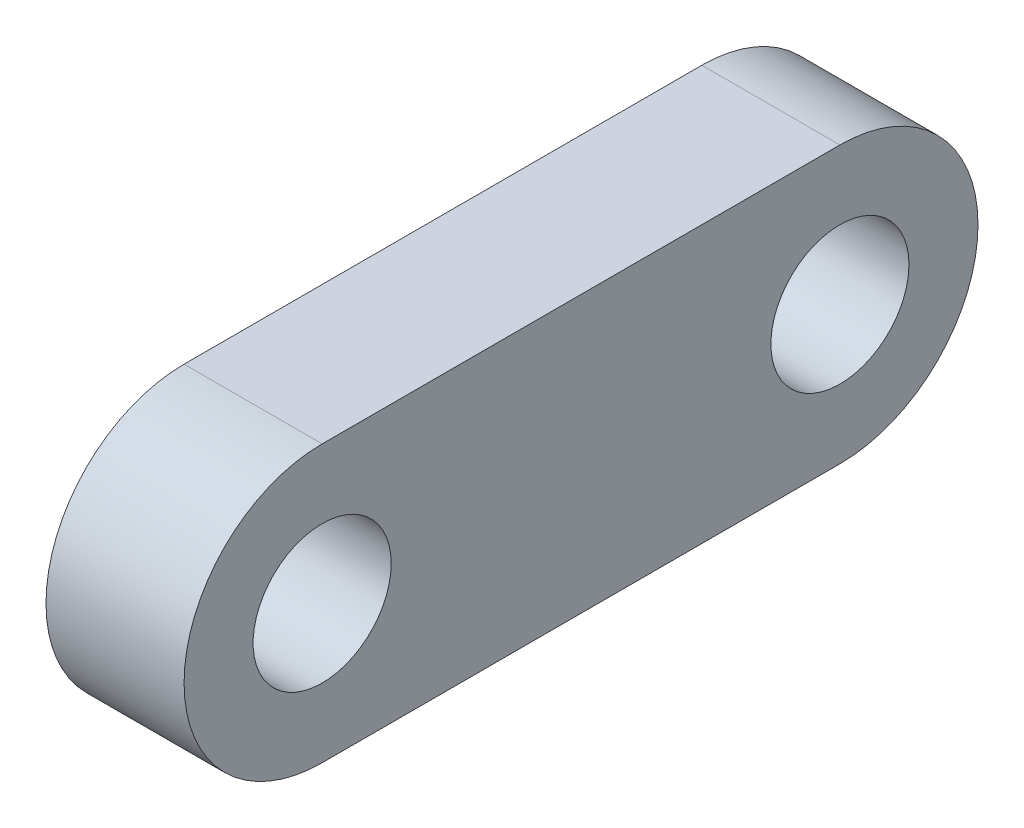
ISO-10303-21;
HEADER;
FILE_DESCRIPTION(('STEP AP214'),'2;1');
FILE_NAME('part.step','',(''),(''),'','','');
FILE_SCHEMA(('AUTOMOTIVE_DESIGN { 1 0 10303 214 1 1 1 1 }'));
ENDSEC;
DATA;
#1=APPLICATION_CONTEXT('core data for automotive mechanical design processes');
#2=APPLICATION_PROTOCOL_DEFINITION('international standard','automotive_design',2000,#1);
#3=PRODUCT_CONTEXT('',#1,'mechanical');
#4=PRODUCT('Part','Part','',(#3));
#5=PRODUCT_RELATED_PRODUCT_CATEGORY('part','',(#4));
#6=PRODUCT_DEFINITION_FORMATION('','',#4);
#7=PRODUCT_DEFINITION_CONTEXT('part definition',#1,'design');
#8=PRODUCT_DEFINITION('design','',#6,#7);
#9=PRODUCT_DEFINITION_SHAPE('','',#8);
#10=(LENGTH_UNIT() NAMED_UNIT(*) SI_UNIT(.MILLI.,.METRE.));
#11=(NAMED_UNIT(*) PLANE_ANGLE_UNIT() SI_UNIT($,.RADIAN.));
#12=(NAMED_UNIT(*) SI_UNIT($,.STERADIAN.) SOLID_ANGLE_UNIT());
#13=UNCERTAINTY_MEASURE_WITH_UNIT(LENGTH_MEASURE(1.E-05),#10,'distance_accuracy_value','');
#14=(GEOMETRIC_REPRESENTATION_CONTEXT(3) GLOBAL_UNCERTAINTY_ASSIGNED_CONTEXT((#13)) GLOBAL_UNIT_ASSIGNED_CONTEXT((#10,
#11,#12)) REPRESENTATION_CONTEXT('',''));
#15=CARTESIAN_POINT('',(0.,0.,0.));
#16=DIRECTION('',(0.,0.,1.));
#17=DIRECTION('',(1.,0.,0.));
#18=AXIS2_PLACEMENT_3D('',#15,#16,#17);
#19=CARTESIAN_POINT('',(20.,0.,75.));
#20=DIRECTION('',(1.,0.,0.));
#21=DIRECTION('',(0.,0.,-1.));
#22=AXIS2_PLACEMENT_3D('',#19,#20,#21);
#23=PLANE('',#22);
#24=CARTESIAN_POINT('',(20.,0.,75.));
#25=DIRECTION('',(1.,0.,0.));
#26=DIRECTION('',(0.,0.,-1.));
#27=AXIS2_PLACEMENT_3D('',#24,#25,#26);
#28=CIRCLE('',#27,20.);
#29=CARTESIAN_POINT('',(20.,0.,55.));
#30=VERTEX_POINT('',#29);
#31=EDGE_CURVE('E107',#30,#30,#28,.T.);
#32=ORIENTED_EDGE('',*,*,#31,.F.);
#33=EDGE_LOOP('',(#32));
#34=FACE_BOUND('',#33,.T.);
#35=CARTESIAN_POINT('',(20.,0.,75.));
#36=DIRECTION('',(1.,0.,0.));
#37=DIRECTION('',(0.,0.,-1.));
#38=AXIS2_PLACEMENT_3D('',#35,#36,#37);
#39=CIRCLE('',#38,40.);
#40=CARTESIAN_POINT('',(20.,40.,75.));
#41=VERTEX_POINT('',#40);
#42=CARTESIAN_POINT('',(20.,-40.,75.));
#43=VERTEX_POINT('',#42);
#44=EDGE_CURVE('E92',#41,#43,#39,.T.);
#45=ORIENTED_EDGE('',*,*,#44,.T.);
#46=DIRECTION('',(0.,0.,-1.));
#47=VECTOR('',#46,1.);
#48=CARTESIAN_POINT('',(20.,-40.,75.));
#49=LINE('',#48,#47);
#50=CARTESIAN_POINT('',(20.,-40.,-75.));
#51=VERTEX_POINT('',#50);
#52=EDGE_CURVE('E87',#43,#51,#49,.T.);
#53=ORIENTED_EDGE('',*,*,#52,.T.);
#54=CARTESIAN_POINT('',(20.,0.,-75.));
#55=DIRECTION('',(1.,0.,0.));
#56=DIRECTION('',(0.,0.,-1.));
#57=AXIS2_PLACEMENT_3D('',#54,#55,#56);
#58=CIRCLE('',#57,40.);
#59=CARTESIAN_POINT('',(20.,40.,-75.));
#60=VERTEX_POINT('',#59);
#61=EDGE_CURVE('E90',#51,#60,#58,.T.);
#62=ORIENTED_EDGE('',*,*,#61,.T.);
#63=DIRECTION('',(0.,0.,1.));
#64=VECTOR('',#63,1.);
#65=CARTESIAN_POINT('',(20.,40.,75.));
#66=LINE('',#65,#64);
#67=EDGE_CURVE('E57',#60,#41,#66,.T.);
#68=ORIENTED_EDGE('',*,*,#67,.T.);
#69=EDGE_LOOP('',(#45,#53,#62,#68));
#70=FACE_BOUND('',#69,.T.);
#71=CARTESIAN_POINT('',(20.,0.,-75.));
#72=DIRECTION('',(1.,0.,0.));
#73=DIRECTION('',(0.,0.,-1.));
#74=AXIS2_PLACEMENT_3D('',#71,#72,#73);
#75=CIRCLE('',#74,20.);
#76=CARTESIAN_POINT('',(20.,0.,-95.));
#77=VERTEX_POINT('',#76);
#78=EDGE_CURVE('E122',#77,#77,#75,.T.);
#79=ORIENTED_EDGE('',*,*,#78,.F.);
#80=EDGE_LOOP('',(#79));
#81=FACE_BOUND('',#80,.T.);
#82=ADVANCED_FACE('F40',(#34,#70,#81),#23,.T.);
#83=CARTESIAN_POINT('',(-20.,0.,75.));
#84=DIRECTION('',(1.,0.,0.));
#85=DIRECTION('',(0.,0.,-1.));
#86=AXIS2_PLACEMENT_3D('',#83,#84,#85);
#87=PLANE('',#86);
#88=CARTESIAN_POINT('',(-20.,0.,75.));
#89=DIRECTION('',(1.,0.,0.));
#90=DIRECTION('',(0.,0.,-1.));
#91=AXIS2_PLACEMENT_3D('',#88,#89,#90);
#92=CIRCLE('',#91,40.);
#93=CARTESIAN_POINT('',(-20.,40.,75.));
#94=VERTEX_POINT('',#93);
#95=CARTESIAN_POINT('',(-20.,-40.,75.));
#96=VERTEX_POINT('',#95);
#97=EDGE_CURVE('E104',#94,#96,#92,.T.);
#98=ORIENTED_EDGE('',*,*,#97,.F.);
#99=DIRECTION('',(0.,0.,1.));
#100=VECTOR('',#99,1.);
#101=CARTESIAN_POINT('',(-20.,40.,75.));
#102=LINE('',#101,#100);
#103=CARTESIAN_POINT('',(-20.,40.,-75.));
#104=VERTEX_POINT('',#103);
#105=EDGE_CURVE('E80',#104,#94,#102,.T.);
#106=ORIENTED_EDGE('',*,*,#105,.F.);
#107=CARTESIAN_POINT('',(-20.,0.,-75.));
#108=DIRECTION('',(1.,0.,0.));
#109=DIRECTION('',(0.,0.,-1.));
#110=AXIS2_PLACEMENT_3D('',#107,#108,#109);
#111=CIRCLE('',#110,40.);
#112=CARTESIAN_POINT('',(-20.,-40.,-75.));
#113=VERTEX_POINT('',#112);
#114=EDGE_CURVE('E74',#113,#104,#111,.T.);
#115=ORIENTED_EDGE('',*,*,#114,.F.);
#116=DIRECTION('',(0.,0.,-1.));
#117=VECTOR('',#116,1.);
#118=CARTESIAN_POINT('',(-20.,-40.,75.));
#119=LINE('',#118,#117);
#120=EDGE_CURVE('E96',#96,#113,#119,.T.);
#121=ORIENTED_EDGE('',*,*,#120,.F.);
#122=EDGE_LOOP('',(#98,#106,#115,#121));
#123=FACE_BOUND('',#122,.T.);
#124=CARTESIAN_POINT('',(-20.,0.,75.));
#125=DIRECTION('',(1.,0.,0.));
#126=DIRECTION('',(0.,0.,-1.));
#127=AXIS2_PLACEMENT_3D('',#124,#125,#126);
#128=CIRCLE('',#127,20.);
#129=CARTESIAN_POINT('',(-20.,0.,55.));
#130=VERTEX_POINT('',#129);
#131=EDGE_CURVE('E119',#130,#130,#128,.T.);
#132=ORIENTED_EDGE('',*,*,#131,.T.);
#133=EDGE_LOOP('',(#132));
#134=FACE_BOUND('',#133,.T.);
#135=CARTESIAN_POINT('',(-20.,0.,-75.));
#136=DIRECTION('',(1.,0.,0.));
#137=DIRECTION('',(0.,0.,-1.));
#138=AXIS2_PLACEMENT_3D('',#135,#136,#137);
#139=CIRCLE('',#138,20.);
#140=CARTESIAN_POINT('',(-20.,0.,-95.));
#141=VERTEX_POINT('',#140);
#142=EDGE_CURVE('E125',#141,#141,#139,.T.);
#143=ORIENTED_EDGE('',*,*,#142,.T.);
#144=EDGE_LOOP('',(#143));
#145=FACE_BOUND('',#144,.T.);
#146=ADVANCED_FACE('F115',(#123,#134,#145),#87,.F.);
#147=CARTESIAN_POINT('',(20.,0.,75.));
#148=DIRECTION('',(-1.,0.,0.));
#149=DIRECTION('',(0.,0.,1.));
#150=AXIS2_PLACEMENT_3D('',#147,#148,#149);
#151=CYLINDRICAL_SURFACE('',#150,40.);
#152=ORIENTED_EDGE('',*,*,#97,.T.);
#153=DIRECTION('',(-1.,0.,0.));
#154=VECTOR('',#153,1.);
#155=CARTESIAN_POINT('',(20.,-40.,75.));
#156=LINE('',#155,#154);
#157=EDGE_CURVE('E11',#43,#96,#156,.T.);
#158=ORIENTED_EDGE('',*,*,#157,.F.);
#159=ORIENTED_EDGE('',*,*,#44,.F.);
#160=DIRECTION('',(-1.,0.,0.));
#161=VECTOR('',#160,1.);
#162=CARTESIAN_POINT('',(20.,40.,75.));
#163=LINE('',#162,#161);
#164=EDGE_CURVE('E100',#41,#94,#163,.T.);
#165=ORIENTED_EDGE('',*,*,#164,.T.);
#166=EDGE_LOOP('',(#152,#158,#159,#165));
#167=FACE_BOUND('',#166,.T.);
#168=ADVANCED_FACE('F42',(#167),#151,.T.);
#169=CARTESIAN_POINT('',(20.,-40.,75.));
#170=DIRECTION('',(0.,1.,0.));
#171=DIRECTION('',(0.,0.,1.));
#172=AXIS2_PLACEMENT_3D('',#169,#170,#171);
#173=PLANE('',#172);
#174=ORIENTED_EDGE('',*,*,#120,.T.);
#175=DIRECTION('',(-1.,0.,0.));
#176=VECTOR('',#175,1.);
#177=CARTESIAN_POINT('',(20.,-40.,-75.));
#178=LINE('',#177,#176);
#179=EDGE_CURVE('E49',#51,#113,#178,.T.);
#180=ORIENTED_EDGE('',*,*,#179,.F.);
#181=ORIENTED_EDGE('',*,*,#52,.F.);
#182=ORIENTED_EDGE('',*,*,#157,.T.);
#183=EDGE_LOOP('',(#174,#180,#181,#182));
#184=FACE_BOUND('',#183,.T.);
#185=ADVANCED_FACE('F95',(#184),#173,.F.);
#186=CARTESIAN_POINT('',(20.,0.,-75.));
#187=DIRECTION('',(-1.,0.,0.));
#188=DIRECTION('',(0.,0.,1.));
#189=AXIS2_PLACEMENT_3D('',#186,#187,#188);
#190=CYLINDRICAL_SURFACE('',#189,40.);
#191=ORIENTED_EDGE('',*,*,#114,.T.);
#192=DIRECTION('',(-1.,0.,0.));
#193=VECTOR('',#192,1.);
#194=CARTESIAN_POINT('',(20.,40.,-75.));
#195=LINE('',#194,#193);
#196=EDGE_CURVE('E97',#60,#104,#195,.T.);
#197=ORIENTED_EDGE('',*,*,#196,.F.);
#198=ORIENTED_EDGE('',*,*,#61,.F.);
#199=ORIENTED_EDGE('',*,*,#179,.T.);
#200=EDGE_LOOP('',(#191,#197,#198,#199));
#201=FACE_BOUND('',#200,.T.);
#202=ADVANCED_FACE('F98',(#201),#190,.T.);
#203=CARTESIAN_POINT('',(20.,40.,75.));
#204=DIRECTION('',(0.,-1.,0.));
#205=DIRECTION('',(0.,0.,-1.));
#206=AXIS2_PLACEMENT_3D('',#203,#204,#205);
#207=PLANE('',#206);
#208=ORIENTED_EDGE('',*,*,#105,.T.);
#209=ORIENTED_EDGE('',*,*,#164,.F.);
#210=ORIENTED_EDGE('',*,*,#67,.F.);
#211=ORIENTED_EDGE('',*,*,#196,.T.);
#212=EDGE_LOOP('',(#208,#209,#210,#211));
#213=FACE_BOUND('',#212,.T.);
#214=ADVANCED_FACE('F112',(#213),#207,.F.);
#215=CARTESIAN_POINT('',(20.,0.,75.));
#216=DIRECTION('',(-1.,0.,0.));
#217=DIRECTION('',(0.,0.,1.));
#218=AXIS2_PLACEMENT_3D('',#215,#216,#217);
#219=CYLINDRICAL_SURFACE('',#218,20.);
#220=ORIENTED_EDGE('',*,*,#31,.T.);
#221=EDGE_LOOP('',(#220));
#222=FACE_BOUND('',#221,.T.);
#223=ORIENTED_EDGE('',*,*,#131,.F.);
#224=EDGE_LOOP('',(#223));
#225=FACE_BOUND('',#224,.T.);
#226=ADVANCED_FACE('F142',(#222,#225),#219,.F.);
#227=CARTESIAN_POINT('',(20.,0.,-75.));
#228=DIRECTION('',(-1.,0.,0.));
#229=DIRECTION('',(0.,0.,1.));
#230=AXIS2_PLACEMENT_3D('',#227,#228,#229);
#231=CYLINDRICAL_SURFACE('',#230,20.);
#232=ORIENTED_EDGE('',*,*,#78,.T.);
#233=EDGE_LOOP('',(#232));
#234=FACE_BOUND('',#233,.T.);
#235=ORIENTED_EDGE('',*,*,#142,.F.);
#236=EDGE_LOOP('',(#235));
#237=FACE_BOUND('',#236,.T.);
#238=ADVANCED_FACE('F131',(#234,#237),#231,.F.);
#239=CLOSED_SHELL('',(#82,#146,#168,#185,#202,#214,#226,#238));
#240=MANIFOLD_SOLID_BREP('B2',#239);
#241=ADVANCED_BREP_SHAPE_REPRESENTATION('',(#18,#240),#14);
#242=SHAPE_DEFINITION_REPRESENTATION(#9,#241);
ENDSEC;
END-ISO-10303-21;
